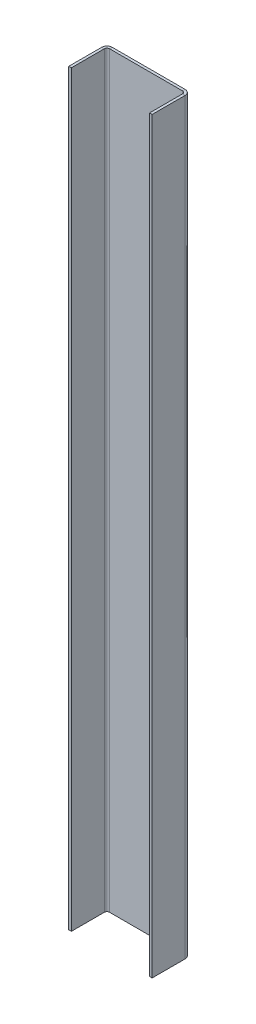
ISO-10303-21;
HEADER;
FILE_DESCRIPTION(('STEP AP214'),'2;1');
FILE_NAME('part.step','',(''),(''),'','','');
FILE_SCHEMA(('AUTOMOTIVE_DESIGN { 1 0 10303 214 1 1 1 1 }'));
ENDSEC;
DATA;
#1=APPLICATION_CONTEXT('core data for automotive mechanical design processes');
#2=APPLICATION_PROTOCOL_DEFINITION('international standard','automotive_design',2000,#1);
#3=PRODUCT_CONTEXT('',#1,'mechanical');
#4=PRODUCT('Part','Part','',(#3));
#5=PRODUCT_RELATED_PRODUCT_CATEGORY('part','',(#4));
#6=PRODUCT_DEFINITION_FORMATION('','',#4);
#7=PRODUCT_DEFINITION_CONTEXT('part definition',#1,'design');
#8=PRODUCT_DEFINITION('design','',#6,#7);
#9=PRODUCT_DEFINITION_SHAPE('','',#8);
#10=(LENGTH_UNIT() NAMED_UNIT(*) SI_UNIT(.MILLI.,.METRE.));
#11=(NAMED_UNIT(*) PLANE_ANGLE_UNIT() SI_UNIT($,.RADIAN.));
#12=(NAMED_UNIT(*) SI_UNIT($,.STERADIAN.) SOLID_ANGLE_UNIT());
#13=UNCERTAINTY_MEASURE_WITH_UNIT(LENGTH_MEASURE(1.E-05),#10,'distance_accuracy_value','');
#14=(GEOMETRIC_REPRESENTATION_CONTEXT(3) GLOBAL_UNCERTAINTY_ASSIGNED_CONTEXT((#13)) GLOBAL_UNIT_ASSIGNED_CONTEXT((#10,
#11,#12)) REPRESENTATION_CONTEXT('',''));
#15=CARTESIAN_POINT('',(0.,0.,0.));
#16=DIRECTION('',(0.,0.,1.));
#17=DIRECTION('',(1.,0.,0.));
#18=AXIS2_PLACEMENT_3D('',#15,#16,#17);
#19=CARTESIAN_POINT('',(76.2000000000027,1366.8375,9.525000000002));
#20=DIRECTION('',(0.,1.,0.));
#21=DIRECTION('',(0.,0.,1.));
#22=AXIS2_PLACEMENT_3D('',#19,#20,#21);
#23=PLANE('',#22);
#24=DIRECTION('',(-1.,0.,0.));
#25=VECTOR('',#24,1.);
#26=CARTESIAN_POINT('',(76.2000000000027,1366.8375,9.525000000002));
#27=LINE('',#26,#25);
#28=CARTESIAN_POINT('',(76.2000000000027,1366.8375,9.525000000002));
#29=VERTEX_POINT('',#28);
#30=CARTESIAN_POINT('',(71.4375000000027,1366.8375,9.52500000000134));
#31=VERTEX_POINT('',#30);
#32=EDGE_CURVE('E11',#29,#31,#27,.T.);
#33=ORIENTED_EDGE('',*,*,#32,.F.);
#34=CARTESIAN_POINT('',(66.6750000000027,1366.8375,9.52500000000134));
#35=DIRECTION('',(0.,-1.,0.));
#36=DIRECTION('',(0.,0.,-1.));
#37=AXIS2_PLACEMENT_3D('',#34,#35,#36);
#38=CIRCLE('',#37,9.525);
#39=CARTESIAN_POINT('',(66.6749999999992,1366.8375,1.33226762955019E-12));
#40=VERTEX_POINT('',#39);
#41=EDGE_CURVE('E150',#29,#40,#38,.F.);
#42=ORIENTED_EDGE('',*,*,#41,.T.);
#43=DIRECTION('',(0.,0.,-1.));
#44=VECTOR('',#43,1.);
#45=CARTESIAN_POINT('',(66.6750000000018,1366.8375,4.76250000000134));
#46=LINE('',#45,#44);
#47=CARTESIAN_POINT('',(66.6750000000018,1366.8375,4.76250000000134));
#48=VERTEX_POINT('',#47);
#49=EDGE_CURVE('E48',#48,#40,#46,.T.);
#50=ORIENTED_EDGE('',*,*,#49,.F.);
#51=CARTESIAN_POINT('',(66.6750000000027,1366.8375,9.52500000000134));
#52=DIRECTION('',(0.,1.,0.));
#53=DIRECTION('',(1.,0.,0.));
#54=AXIS2_PLACEMENT_3D('',#51,#52,#53);
#55=CIRCLE('',#54,4.7625);
#56=EDGE_CURVE('E244',#31,#48,#55,.T.);
#57=ORIENTED_EDGE('',*,*,#56,.F.);
#58=EDGE_LOOP('',(#33,#42,#50,#57));
#59=FACE_BOUND('',#58,.T.);
#60=ADVANCED_FACE('F40',(#59),#23,.T.);
#61=CARTESIAN_POINT('',(66.6750000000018,1366.8375,4.76250000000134));
#62=DIRECTION('',(0.,1.,0.));
#63=DIRECTION('',(0.,0.,1.));
#64=AXIS2_PLACEMENT_3D('',#61,#62,#63);
#65=PLANE('',#64);
#66=DIRECTION('',(0.,0.,-1.));
#67=VECTOR('',#66,1.);
#68=CARTESIAN_POINT('',(76.2,1366.8375,1.99840144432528E-12));
#69=LINE('',#68,#67);
#70=CARTESIAN_POINT('',(76.2,1366.8375,69.8500000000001));
#71=VERTEX_POINT('',#70);
#72=EDGE_CURVE('E155',#71,#29,#69,.T.);
#73=ORIENTED_EDGE('',*,*,#72,.T.);
#74=ORIENTED_EDGE('',*,*,#32,.T.);
#75=DIRECTION('',(0.,0.,-1.));
#76=VECTOR('',#75,1.);
#77=CARTESIAN_POINT('',(71.4375,1366.8375,1.33226762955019E-12));
#78=LINE('',#77,#76);
#79=CARTESIAN_POINT('',(71.4375,1366.8375,69.8500000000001));
#80=VERTEX_POINT('',#79);
#81=EDGE_CURVE('E257',#80,#31,#78,.T.);
#82=ORIENTED_EDGE('',*,*,#81,.F.);
#83=DIRECTION('',(-1.,0.,0.));
#84=VECTOR('',#83,1.);
#85=CARTESIAN_POINT('',(76.2,1366.8375,69.8500000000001));
#86=LINE('',#85,#84);
#87=EDGE_CURVE('E259',#71,#80,#86,.T.);
#88=ORIENTED_EDGE('',*,*,#87,.F.);
#89=EDGE_LOOP('',(#73,#74,#82,#88));
#90=FACE_BOUND('',#89,.T.);
#91=ADVANCED_FACE('F270',(#90),#65,.T.);
#92=CARTESIAN_POINT('',(66.675,6.66133814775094E-13,0.));
#93=DIRECTION('',(0.,-1.,0.));
#94=DIRECTION('',(0.,0.,-1.));
#95=AXIS2_PLACEMENT_3D('',#92,#93,#94);
#96=PLANE('',#95);
#97=DIRECTION('',(0.,0.,1.));
#98=VECTOR('',#97,1.);
#99=CARTESIAN_POINT('',(66.675,6.66133814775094E-13,0.));
#100=LINE('',#99,#98);
#101=CARTESIAN_POINT('',(66.675,6.66133814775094E-13,0.));
#102=VERTEX_POINT('',#101);
#103=CARTESIAN_POINT('',(66.675,6.66133814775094E-13,4.7625));
#104=VERTEX_POINT('',#103);
#105=EDGE_CURVE('E148',#102,#104,#100,.T.);
#106=ORIENTED_EDGE('',*,*,#105,.F.);
#107=CARTESIAN_POINT('',(66.675,6.66133814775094E-13,9.52500000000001));
#108=DIRECTION('',(0.,-1.,0.));
#109=DIRECTION('',(0.,0.,-1.));
#110=AXIS2_PLACEMENT_3D('',#107,#108,#109);
#111=CIRCLE('',#110,9.525);
#112=CARTESIAN_POINT('',(76.2,0.,9.52500000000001));
#113=VERTEX_POINT('',#112);
#114=EDGE_CURVE('E162',#113,#102,#111,.F.);
#115=ORIENTED_EDGE('',*,*,#114,.F.);
#116=DIRECTION('',(1.,0.,0.));
#117=VECTOR('',#116,1.);
#118=CARTESIAN_POINT('',(71.4375,0.,9.52500000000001));
#119=LINE('',#118,#117);
#120=CARTESIAN_POINT('',(71.4375,0.,9.52500000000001));
#121=VERTEX_POINT('',#120);
#122=EDGE_CURVE('E235',#121,#113,#119,.T.);
#123=ORIENTED_EDGE('',*,*,#122,.F.);
#124=CARTESIAN_POINT('',(66.675,6.66133814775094E-13,9.52500000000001));
#125=DIRECTION('',(0.,1.,0.));
#126=DIRECTION('',(1.,0.,0.));
#127=AXIS2_PLACEMENT_3D('',#124,#125,#126);
#128=CIRCLE('',#127,4.7625);
#129=EDGE_CURVE('E189',#121,#104,#128,.T.);
#130=ORIENTED_EDGE('',*,*,#129,.T.);
#131=EDGE_LOOP('',(#106,#115,#123,#130));
#132=FACE_BOUND('',#131,.T.);
#133=ADVANCED_FACE('F249',(#132),#96,.T.);
#134=CARTESIAN_POINT('',(71.4375,0.,9.52500000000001));
#135=DIRECTION('',(0.,-1.,0.));
#136=DIRECTION('',(0.,0.,-1.));
#137=AXIS2_PLACEMENT_3D('',#134,#135,#136);
#138=PLANE('',#137);
#139=DIRECTION('',(-1.,0.,0.));
#140=VECTOR('',#139,1.);
#141=CARTESIAN_POINT('',(-76.2,0.,0.));
#142=LINE('',#141,#140);
#143=CARTESIAN_POINT('',(-66.675,0.,-6.66133814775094E-13));
#144=VERTEX_POINT('',#143);
#145=EDGE_CURVE('E202',#102,#144,#142,.T.);
#146=ORIENTED_EDGE('',*,*,#145,.F.);
#147=ORIENTED_EDGE('',*,*,#105,.T.);
#148=DIRECTION('',(1.,0.,0.));
#149=VECTOR('',#148,1.);
#150=CARTESIAN_POINT('',(-76.2,0.,4.7625));
#151=LINE('',#150,#149);
#152=CARTESIAN_POINT('',(-66.675,0.,4.76249999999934));
#153=VERTEX_POINT('',#152);
#154=EDGE_CURVE('E187',#104,#153,#151,.F.);
#155=ORIENTED_EDGE('',*,*,#154,.T.);
#156=DIRECTION('',(0.,0.,-1.));
#157=VECTOR('',#156,1.);
#158=CARTESIAN_POINT('',(-66.675,0.,4.76249999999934));
#159=LINE('',#158,#157);
#160=EDGE_CURVE('E97',#153,#144,#159,.T.);
#161=ORIENTED_EDGE('',*,*,#160,.T.);
#162=EDGE_LOOP('',(#146,#147,#155,#161));
#163=FACE_BOUND('',#162,.T.);
#164=ADVANCED_FACE('F237',(#163),#138,.T.);
#165=CARTESIAN_POINT('',(-66.675,1366.8375,1.33226762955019E-12));
#166=DIRECTION('',(0.,1.,0.));
#167=DIRECTION('',(0.,0.,1.));
#168=AXIS2_PLACEMENT_3D('',#165,#166,#167);
#169=PLANE('',#168);
#170=DIRECTION('',(0.,0.,1.));
#171=VECTOR('',#170,1.);
#172=CARTESIAN_POINT('',(-66.675,1366.8375,1.33226762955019E-12));
#173=LINE('',#172,#171);
#174=CARTESIAN_POINT('',(-66.675,1366.8375,1.33226762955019E-12));
#175=VERTEX_POINT('',#174);
#176=CARTESIAN_POINT('',(-66.6749999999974,1366.8375,4.76250000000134));
#177=VERTEX_POINT('',#176);
#178=EDGE_CURVE('E233',#175,#177,#173,.T.);
#179=ORIENTED_EDGE('',*,*,#178,.F.);
#180=CARTESIAN_POINT('',(-66.6749999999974,1366.8375,9.52500000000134));
#181=DIRECTION('',(0.,-1.,0.));
#182=DIRECTION('',(0.,0.,-1.));
#183=AXIS2_PLACEMENT_3D('',#180,#181,#182);
#184=CIRCLE('',#183,9.525);
#185=CARTESIAN_POINT('',(-76.1999999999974,1366.8375,9.525000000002));
#186=VERTEX_POINT('',#185);
#187=EDGE_CURVE('E170',#175,#186,#184,.F.);
#188=ORIENTED_EDGE('',*,*,#187,.T.);
#189=DIRECTION('',(-1.,0.,0.));
#190=VECTOR('',#189,1.);
#191=CARTESIAN_POINT('',(-71.4374999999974,1366.8375,9.525000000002));
#192=LINE('',#191,#190);
#193=CARTESIAN_POINT('',(-71.4374999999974,1366.8375,9.525000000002));
#194=VERTEX_POINT('',#193);
#195=EDGE_CURVE('E56',#194,#186,#192,.T.);
#196=ORIENTED_EDGE('',*,*,#195,.F.);
#197=CARTESIAN_POINT('',(-66.6749999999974,1366.8375,9.52500000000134));
#198=DIRECTION('',(0.,1.,0.));
#199=DIRECTION('',(1.,0.,0.));
#200=AXIS2_PLACEMENT_3D('',#197,#198,#199);
#201=CIRCLE('',#200,4.7625);
#202=EDGE_CURVE('E261',#177,#194,#201,.T.);
#203=ORIENTED_EDGE('',*,*,#202,.F.);
#204=EDGE_LOOP('',(#179,#188,#196,#203));
#205=FACE_BOUND('',#204,.T.);
#206=ADVANCED_FACE('F296',(#205),#169,.T.);
#207=CARTESIAN_POINT('',(-71.4374999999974,1366.8375,9.525000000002));
#208=DIRECTION('',(0.,1.,0.));
#209=DIRECTION('',(0.,0.,1.));
#210=AXIS2_PLACEMENT_3D('',#207,#208,#209);
#211=PLANE('',#210);
#212=DIRECTION('',(-1.,0.,0.));
#213=VECTOR('',#212,1.);
#214=CARTESIAN_POINT('',(-76.2,1366.8375,1.99840144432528E-12));
#215=LINE('',#214,#213);
#216=EDGE_CURVE('E140',#40,#175,#215,.T.);
#217=ORIENTED_EDGE('',*,*,#216,.T.);
#218=ORIENTED_EDGE('',*,*,#178,.T.);
#219=DIRECTION('',(1.,0.,0.));
#220=VECTOR('',#219,1.);
#221=CARTESIAN_POINT('',(-76.1999999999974,1366.8375,4.762500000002));
#222=LINE('',#221,#220);
#223=EDGE_CURVE('E143',#48,#177,#222,.F.);
#224=ORIENTED_EDGE('',*,*,#223,.F.);
#225=ORIENTED_EDGE('',*,*,#49,.T.);
#226=EDGE_LOOP('',(#217,#218,#224,#225));
#227=FACE_BOUND('',#226,.T.);
#228=ADVANCED_FACE('F138',(#227),#211,.T.);
#229=CARTESIAN_POINT('',(-76.2,0.,9.52500000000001));
#230=DIRECTION('',(0.,-1.,0.));
#231=DIRECTION('',(0.,0.,-1.));
#232=AXIS2_PLACEMENT_3D('',#229,#230,#231);
#233=PLANE('',#232);
#234=DIRECTION('',(1.,0.,0.));
#235=VECTOR('',#234,1.);
#236=CARTESIAN_POINT('',(-76.2,0.,9.52500000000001));
#237=LINE('',#236,#235);
#238=CARTESIAN_POINT('',(-76.2,0.,9.52500000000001));
#239=VERTEX_POINT('',#238);
#240=CARTESIAN_POINT('',(-71.4375,0.,9.52500000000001));
#241=VERTEX_POINT('',#240);
#242=EDGE_CURVE('E104',#239,#241,#237,.T.);
#243=ORIENTED_EDGE('',*,*,#242,.F.);
#244=CARTESIAN_POINT('',(-66.675,0.,9.52499999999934));
#245=DIRECTION('',(0.,-1.,0.));
#246=DIRECTION('',(0.,0.,-1.));
#247=AXIS2_PLACEMENT_3D('',#244,#245,#246);
#248=CIRCLE('',#247,9.525);
#249=EDGE_CURVE('E204',#144,#239,#248,.F.);
#250=ORIENTED_EDGE('',*,*,#249,.F.);
#251=ORIENTED_EDGE('',*,*,#160,.F.);
#252=CARTESIAN_POINT('',(-66.675,0.,9.52499999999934));
#253=DIRECTION('',(0.,1.,0.));
#254=DIRECTION('',(1.,0.,0.));
#255=AXIS2_PLACEMENT_3D('',#252,#253,#254);
#256=CIRCLE('',#255,4.7625);
#257=EDGE_CURVE('E185',#153,#241,#256,.T.);
#258=ORIENTED_EDGE('',*,*,#257,.T.);
#259=EDGE_LOOP('',(#243,#250,#251,#258));
#260=FACE_BOUND('',#259,.T.);
#261=ADVANCED_FACE('F302',(#260),#233,.T.);
#262=CARTESIAN_POINT('',(-66.675,0.,4.76249999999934));
#263=DIRECTION('',(0.,-1.,0.));
#264=DIRECTION('',(0.,0.,-1.));
#265=AXIS2_PLACEMENT_3D('',#262,#263,#264);
#266=PLANE('',#265);
#267=DIRECTION('',(0.,0.,1.));
#268=VECTOR('',#267,1.);
#269=CARTESIAN_POINT('',(-76.2,0.,0.));
#270=LINE('',#269,#268);
#271=CARTESIAN_POINT('',(-76.1999999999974,0.,69.8499999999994));
#272=VERTEX_POINT('',#271);
#273=EDGE_CURVE('E176',#239,#272,#270,.T.);
#274=ORIENTED_EDGE('',*,*,#273,.F.);
#275=ORIENTED_EDGE('',*,*,#242,.T.);
#276=DIRECTION('',(0.,0.,-1.));
#277=VECTOR('',#276,1.);
#278=CARTESIAN_POINT('',(-71.4375,0.,0.));
#279=LINE('',#278,#277);
#280=CARTESIAN_POINT('',(-71.4374999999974,6.66133814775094E-13,69.8499999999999));
#281=VERTEX_POINT('',#280);
#282=EDGE_CURVE('E182',#241,#281,#279,.F.);
#283=ORIENTED_EDGE('',*,*,#282,.T.);
#284=DIRECTION('',(-1.,0.,0.));
#285=VECTOR('',#284,1.);
#286=CARTESIAN_POINT('',(-71.4374999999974,6.66133814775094E-13,69.8499999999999));
#287=LINE('',#286,#285);
#288=EDGE_CURVE('E179',#281,#272,#287,.T.);
#289=ORIENTED_EDGE('',*,*,#288,.T.);
#290=EDGE_LOOP('',(#274,#275,#283,#289));
#291=FACE_BOUND('',#290,.T.);
#292=ADVANCED_FACE('F305',(#291),#266,.T.);
#293=CARTESIAN_POINT('',(-76.2,1366.8375,1.99840144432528E-12));
#294=DIRECTION('',(1.,0.,0.));
#295=DIRECTION('',(0.,0.,-1.));
#296=AXIS2_PLACEMENT_3D('',#293,#294,#295);
#297=PLANE('',#296);
#298=ORIENTED_EDGE('',*,*,#273,.T.);
#299=DIRECTION('',(0.,-1.,0.));
#300=VECTOR('',#299,1.);
#301=CARTESIAN_POINT('',(-76.2,1366.8375,69.8500000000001));
#302=LINE('',#301,#300);
#303=CARTESIAN_POINT('',(-76.2,1366.8375,69.8500000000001));
#304=VERTEX_POINT('',#303);
#305=EDGE_CURVE('E228',#304,#272,#302,.T.);
#306=ORIENTED_EDGE('',*,*,#305,.F.);
#307=DIRECTION('',(0.,0.,1.));
#308=VECTOR('',#307,1.);
#309=CARTESIAN_POINT('',(-76.2,1366.8375,1.99840144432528E-12));
#310=LINE('',#309,#308);
#311=EDGE_CURVE('E110',#186,#304,#310,.T.);
#312=ORIENTED_EDGE('',*,*,#311,.F.);
#313=DIRECTION('',(0.,-1.,0.));
#314=VECTOR('',#313,1.);
#315=CARTESIAN_POINT('',(-76.1999999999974,1366.8375,9.525000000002));
#316=LINE('',#315,#314);
#317=EDGE_CURVE('E172',#186,#239,#316,.T.);
#318=ORIENTED_EDGE('',*,*,#317,.T.);
#319=EDGE_LOOP('',(#298,#306,#312,#318));
#320=FACE_BOUND('',#319,.T.);
#321=ADVANCED_FACE('F308',(#320),#297,.F.);
#322=CARTESIAN_POINT('',(-71.4375,1366.8375,69.8500000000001));
#323=DIRECTION('',(0.,0.,1.));
#324=DIRECTION('',(1.,0.,0.));
#325=AXIS2_PLACEMENT_3D('',#322,#323,#324);
#326=PLANE('',#325);
#327=ORIENTED_EDGE('',*,*,#288,.F.);
#328=DIRECTION('',(0.,-1.,0.));
#329=VECTOR('',#328,1.);
#330=CARTESIAN_POINT('',(-71.4375,1366.8375,69.8500000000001));
#331=LINE('',#330,#329);
#332=CARTESIAN_POINT('',(-71.4375,1366.8375,69.8500000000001));
#333=VERTEX_POINT('',#332);
#334=EDGE_CURVE('E226',#333,#281,#331,.T.);
#335=ORIENTED_EDGE('',*,*,#334,.F.);
#336=DIRECTION('',(-1.,0.,0.));
#337=VECTOR('',#336,1.);
#338=CARTESIAN_POINT('',(-71.4375,1366.8375,69.8500000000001));
#339=LINE('',#338,#337);
#340=EDGE_CURVE('E472',#333,#304,#339,.T.);
#341=ORIENTED_EDGE('',*,*,#340,.T.);
#342=ORIENTED_EDGE('',*,*,#305,.T.);
#343=EDGE_LOOP('',(#327,#335,#341,#342));
#344=FACE_BOUND('',#343,.T.);
#345=ADVANCED_FACE('F312',(#344),#326,.T.);
#346=CARTESIAN_POINT('',(-71.4375,1366.8375,1.99840144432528E-12));
#347=DIRECTION('',(1.,0.,0.));
#348=DIRECTION('',(0.,0.,-1.));
#349=AXIS2_PLACEMENT_3D('',#346,#347,#348);
#350=PLANE('',#349);
#351=ORIENTED_EDGE('',*,*,#282,.F.);
#352=DIRECTION('',(0.,-1.,0.));
#353=VECTOR('',#352,1.);
#354=CARTESIAN_POINT('',(-71.4374999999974,1366.8375,9.525000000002));
#355=LINE('',#354,#353);
#356=EDGE_CURVE('E223',#194,#241,#355,.T.);
#357=ORIENTED_EDGE('',*,*,#356,.F.);
#358=DIRECTION('',(0.,0.,-1.));
#359=VECTOR('',#358,1.);
#360=CARTESIAN_POINT('',(-71.4375,1366.8375,1.99840144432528E-12));
#361=LINE('',#360,#359);
#362=EDGE_CURVE('E474',#194,#333,#361,.F.);
#363=ORIENTED_EDGE('',*,*,#362,.T.);
#364=ORIENTED_EDGE('',*,*,#334,.T.);
#365=EDGE_LOOP('',(#351,#357,#363,#364));
#366=FACE_BOUND('',#365,.T.);
#367=ADVANCED_FACE('F316',(#366),#350,.T.);
#368=CARTESIAN_POINT('',(-66.6749999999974,1366.8375,9.52500000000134));
#369=DIRECTION('',(0.,-1.,0.));
#370=DIRECTION('',(0.,0.,-1.));
#371=AXIS2_PLACEMENT_3D('',#368,#369,#370);
#372=CYLINDRICAL_SURFACE('',#371,4.7625);
#373=ORIENTED_EDGE('',*,*,#257,.F.);
#374=DIRECTION('',(0.,-1.,0.));
#375=VECTOR('',#374,1.);
#376=CARTESIAN_POINT('',(-66.6749999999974,1366.8375,4.76250000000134));
#377=LINE('',#376,#375);
#378=EDGE_CURVE('E220',#177,#153,#377,.T.);
#379=ORIENTED_EDGE('',*,*,#378,.F.);
#380=ORIENTED_EDGE('',*,*,#202,.T.);
#381=ORIENTED_EDGE('',*,*,#356,.T.);
#382=EDGE_LOOP('',(#373,#379,#380,#381));
#383=FACE_BOUND('',#382,.T.);
#384=ADVANCED_FACE('F320',(#383),#372,.F.);
#385=CARTESIAN_POINT('',(-76.1999999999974,1366.8375,4.762500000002));
#386=DIRECTION('',(0.,0.,1.));
#387=DIRECTION('',(1.,0.,0.));
#388=AXIS2_PLACEMENT_3D('',#385,#386,#387);
#389=PLANE('',#388);
#390=ORIENTED_EDGE('',*,*,#154,.F.);
#391=DIRECTION('',(0.,-1.,0.));
#392=VECTOR('',#391,1.);
#393=CARTESIAN_POINT('',(66.6750000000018,1366.8375,4.76250000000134));
#394=LINE('',#393,#392);
#395=EDGE_CURVE('E217',#48,#104,#394,.T.);
#396=ORIENTED_EDGE('',*,*,#395,.F.);
#397=ORIENTED_EDGE('',*,*,#223,.T.);
#398=ORIENTED_EDGE('',*,*,#378,.T.);
#399=EDGE_LOOP('',(#390,#396,#397,#398));
#400=FACE_BOUND('',#399,.T.);
#401=ADVANCED_FACE('F246',(#400),#389,.T.);
#402=CARTESIAN_POINT('',(66.6750000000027,1366.8375,9.52500000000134));
#403=DIRECTION('',(0.,-1.,0.));
#404=DIRECTION('',(0.,0.,-1.));
#405=AXIS2_PLACEMENT_3D('',#402,#403,#404);
#406=CYLINDRICAL_SURFACE('',#405,4.7625);
#407=ORIENTED_EDGE('',*,*,#129,.F.);
#408=DIRECTION('',(0.,-1.,0.));
#409=VECTOR('',#408,1.);
#410=CARTESIAN_POINT('',(71.4375000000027,1366.8375,9.52500000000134));
#411=LINE('',#410,#409);
#412=EDGE_CURVE('E214',#31,#121,#411,.T.);
#413=ORIENTED_EDGE('',*,*,#412,.F.);
#414=ORIENTED_EDGE('',*,*,#56,.T.);
#415=ORIENTED_EDGE('',*,*,#395,.T.);
#416=EDGE_LOOP('',(#407,#413,#414,#415));
#417=FACE_BOUND('',#416,.T.);
#418=ADVANCED_FACE('F242',(#417),#406,.F.);
#419=CARTESIAN_POINT('',(71.4375,1366.8375,1.33226762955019E-12));
#420=DIRECTION('',(-1.,0.,0.));
#421=DIRECTION('',(0.,0.,1.));
#422=AXIS2_PLACEMENT_3D('',#419,#420,#421);
#423=PLANE('',#422);
#424=DIRECTION('',(0.,0.,-1.));
#425=VECTOR('',#424,1.);
#426=CARTESIAN_POINT('',(71.4375,0.,0.));
#427=LINE('',#426,#425);
#428=CARTESIAN_POINT('',(71.4375000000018,6.66133814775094E-13,69.8499999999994));
#429=VERTEX_POINT('',#428);
#430=EDGE_CURVE('E192',#429,#121,#427,.T.);
#431=ORIENTED_EDGE('',*,*,#430,.F.);
#432=DIRECTION('',(0.,-1.,0.));
#433=VECTOR('',#432,1.);
#434=CARTESIAN_POINT('',(71.4375,1366.8375,69.8500000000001));
#435=LINE('',#434,#433);
#436=EDGE_CURVE('E212',#80,#429,#435,.T.);
#437=ORIENTED_EDGE('',*,*,#436,.F.);
#438=ORIENTED_EDGE('',*,*,#81,.T.);
#439=ORIENTED_EDGE('',*,*,#412,.T.);
#440=EDGE_LOOP('',(#431,#437,#438,#439));
#441=FACE_BOUND('',#440,.T.);
#442=ADVANCED_FACE('F255',(#441),#423,.T.);
#443=CARTESIAN_POINT('',(76.2,1366.8375,69.8500000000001));
#444=DIRECTION('',(0.,0.,1.));
#445=DIRECTION('',(1.,0.,0.));
#446=AXIS2_PLACEMENT_3D('',#443,#444,#445);
#447=PLANE('',#446);
#448=DIRECTION('',(-1.,0.,0.));
#449=VECTOR('',#448,1.);
#450=CARTESIAN_POINT('',(76.2000000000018,0.,69.8499999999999));
#451=LINE('',#450,#449);
#452=CARTESIAN_POINT('',(76.2000000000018,0.,69.8499999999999));
#453=VERTEX_POINT('',#452);
#454=EDGE_CURVE('E195',#453,#429,#451,.T.);
#455=ORIENTED_EDGE('',*,*,#454,.F.);
#456=DIRECTION('',(0.,-1.,0.));
#457=VECTOR('',#456,1.);
#458=CARTESIAN_POINT('',(76.2,1366.8375,69.8500000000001));
#459=LINE('',#458,#457);
#460=EDGE_CURVE('E210',#71,#453,#459,.T.);
#461=ORIENTED_EDGE('',*,*,#460,.F.);
#462=ORIENTED_EDGE('',*,*,#87,.T.);
#463=ORIENTED_EDGE('',*,*,#436,.T.);
#464=EDGE_LOOP('',(#455,#461,#462,#463));
#465=FACE_BOUND('',#464,.T.);
#466=ADVANCED_FACE('F276',(#465),#447,.T.);
#467=CARTESIAN_POINT('',(76.2,1366.8375,1.99840144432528E-12));
#468=DIRECTION('',(-1.,0.,0.));
#469=DIRECTION('',(0.,0.,1.));
#470=AXIS2_PLACEMENT_3D('',#467,#468,#469);
#471=PLANE('',#470);
#472=DIRECTION('',(0.,0.,-1.));
#473=VECTOR('',#472,1.);
#474=CARTESIAN_POINT('',(76.2,0.,0.));
#475=LINE('',#474,#473);
#476=EDGE_CURVE('E198',#453,#113,#475,.T.);
#477=ORIENTED_EDGE('',*,*,#476,.T.);
#478=DIRECTION('',(0.,-1.,0.));
#479=VECTOR('',#478,1.);
#480=CARTESIAN_POINT('',(76.2000000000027,1366.8375,9.525000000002));
#481=LINE('',#480,#479);
#482=EDGE_CURVE('E164',#29,#113,#481,.T.);
#483=ORIENTED_EDGE('',*,*,#482,.F.);
#484=ORIENTED_EDGE('',*,*,#72,.F.);
#485=ORIENTED_EDGE('',*,*,#460,.T.);
#486=EDGE_LOOP('',(#477,#483,#484,#485));
#487=FACE_BOUND('',#486,.T.);
#488=ADVANCED_FACE('F272',(#487),#471,.F.);
#489=CARTESIAN_POINT('',(66.6750000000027,1366.8375,9.52500000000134));
#490=DIRECTION('',(0.,-1.,0.));
#491=DIRECTION('',(0.,0.,-1.));
#492=AXIS2_PLACEMENT_3D('',#489,#490,#491);
#493=CYLINDRICAL_SURFACE('',#492,9.525);
#494=ORIENTED_EDGE('',*,*,#114,.T.);
#495=DIRECTION('',(0.,-1.,0.));
#496=VECTOR('',#495,1.);
#497=CARTESIAN_POINT('',(66.6749999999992,1366.8375,1.33226762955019E-12));
#498=LINE('',#497,#496);
#499=EDGE_CURVE('E159',#40,#102,#498,.T.);
#500=ORIENTED_EDGE('',*,*,#499,.F.);
#501=ORIENTED_EDGE('',*,*,#41,.F.);
#502=ORIENTED_EDGE('',*,*,#482,.T.);
#503=EDGE_LOOP('',(#494,#500,#501,#502));
#504=FACE_BOUND('',#503,.T.);
#505=ADVANCED_FACE('F160',(#504),#493,.T.);
#506=CARTESIAN_POINT('',(-76.2,1366.8375,1.99840144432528E-12));
#507=DIRECTION('',(0.,0.,1.));
#508=DIRECTION('',(1.,0.,0.));
#509=AXIS2_PLACEMENT_3D('',#506,#507,#508);
#510=PLANE('',#509);
#511=ORIENTED_EDGE('',*,*,#145,.T.);
#512=DIRECTION('',(0.,-1.,0.));
#513=VECTOR('',#512,1.);
#514=CARTESIAN_POINT('',(-66.675,1366.8375,1.33226762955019E-12));
#515=LINE('',#514,#513);
#516=EDGE_CURVE('E165',#175,#144,#515,.T.);
#517=ORIENTED_EDGE('',*,*,#516,.F.);
#518=ORIENTED_EDGE('',*,*,#216,.F.);
#519=ORIENTED_EDGE('',*,*,#499,.T.);
#520=EDGE_LOOP('',(#511,#517,#518,#519));
#521=FACE_BOUND('',#520,.T.);
#522=ADVANCED_FACE('F167',(#521),#510,.F.);
#523=CARTESIAN_POINT('',(-66.6749999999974,1366.8375,9.52500000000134));
#524=DIRECTION('',(0.,-1.,0.));
#525=DIRECTION('',(0.,0.,-1.));
#526=AXIS2_PLACEMENT_3D('',#523,#524,#525);
#527=CYLINDRICAL_SURFACE('',#526,9.525);
#528=ORIENTED_EDGE('',*,*,#249,.T.);
#529=ORIENTED_EDGE('',*,*,#317,.F.);
#530=ORIENTED_EDGE('',*,*,#187,.F.);
#531=ORIENTED_EDGE('',*,*,#516,.T.);
#532=EDGE_LOOP('',(#528,#529,#530,#531));
#533=FACE_BOUND('',#532,.T.);
#534=ADVANCED_FACE('F367',(#533),#527,.T.);
#535=CARTESIAN_POINT('',(-66.6749999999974,1366.8375,9.52500000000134));
#536=DIRECTION('',(0.,1.,0.));
#537=DIRECTION('',(1.,0.,0.));
#538=AXIS2_PLACEMENT_3D('',#535,#536,#537);
#539=PLANE('',#538);
#540=ORIENTED_EDGE('',*,*,#311,.T.);
#541=ORIENTED_EDGE('',*,*,#340,.F.);
#542=ORIENTED_EDGE('',*,*,#362,.F.);
#543=ORIENTED_EDGE('',*,*,#195,.T.);
#544=EDGE_LOOP('',(#540,#541,#542,#543));
#545=FACE_BOUND('',#544,.T.);
#546=ADVANCED_FACE('F377',(#545),#539,.T.);
#547=CARTESIAN_POINT('',(-66.675,0.,9.52499999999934));
#548=DIRECTION('',(0.,1.,0.));
#549=DIRECTION('',(1.,0.,0.));
#550=AXIS2_PLACEMENT_3D('',#547,#548,#549);
#551=PLANE('',#550);
#552=ORIENTED_EDGE('',*,*,#430,.T.);
#553=ORIENTED_EDGE('',*,*,#122,.T.);
#554=ORIENTED_EDGE('',*,*,#476,.F.);
#555=ORIENTED_EDGE('',*,*,#454,.T.);
#556=EDGE_LOOP('',(#552,#553,#554,#555));
#557=FACE_BOUND('',#556,.T.);
#558=ADVANCED_FACE('F274',(#557),#551,.F.);
#559=CLOSED_SHELL('',(#60,#91,#133,#164,#206,#228,#261,#292,#321,#345,#367,#384,#401,#418,#442,
#466,#488,#505,#522,#534,#546,#558));
#560=MANIFOLD_SOLID_BREP('B2',#559);
#561=ADVANCED_BREP_SHAPE_REPRESENTATION('',(#18,#560),#14);
#562=SHAPE_DEFINITION_REPRESENTATION(#9,#561);
ENDSEC;
END-ISO-10303-21;
